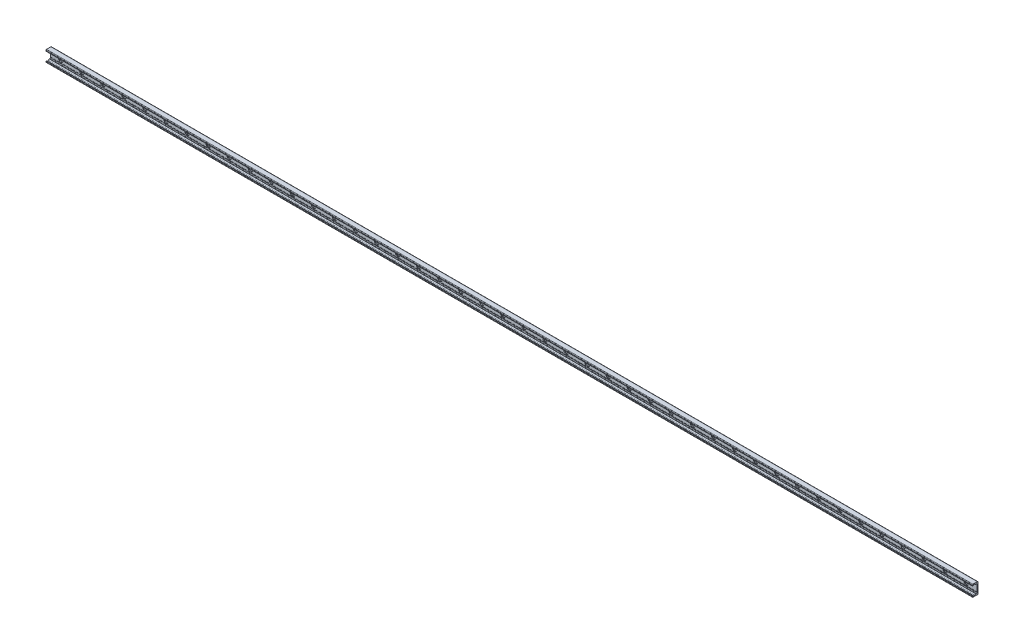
from build123d import *

# Parameters (mm, degrees)
BOSS_EXTRUDE1_DEPTH = 1760
SKETCH2_R           = 9
SKETCH2_R_2         = 4.5
CUT_EXTRUDE1_DEPTH  = 3.1
SKETCH2_2_R         = 4.5
CUT_EXTRUDE2_DEPTH  = 1761.208652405
LPATTERN1_COUNT     = 44
LPATTERN1_PITCH     = 80


with BuildPart() as part:
    # Sketch1 → Boss-Extrude1 (new, symmetric)
    with BuildSketch(Plane(origin=(0, 0, 0), x_dir=(0, 0, -1), z_dir=(1, 0, 0))):
        with BuildLine():
            Line((0, 0), (0, 19))
            ThreePointArc((0, 19), (-0.732233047, 20.767766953), (-2.5, 21.5))
            Line((-2.5, 21.5), (-19, 21.5))
            ThreePointArc((-19, 21.5), (-20.414213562, 20.914213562), (-21, 19.5))
            Line((-21, 19.5), (-21, 16.625057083))
            ThreePointArc((-21, 16.625057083), (-20.553251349, 15.888838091), (-19.693931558, 15.945160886))
            Line((-19.693931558, 15.945160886), (-16.794305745, 17.975500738))
            ThreePointArc((-16.794305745, 17.975500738), (-14.5, 18.69889256), (-12.205694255, 17.975500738))
            Line((-12.205694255, 17.975500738), (-8.829831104, 15.611695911))
            ThreePointArc((-8.829831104, 15.611695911), (-8.28408983, 15.342566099), (-7.682678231, 15.25))
            Line((-7.682678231, 15.25), (-6.5, 15.25))
            ThreePointArc((-6.5, 15.25), (-5.085786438, 14.664213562), (-4.5, 13.25))
            Line((-4.5, 13.25), (-4.5, -10.75))
            ThreePointArc((-4.5, -10.75), (-4.25, -11), (-4.5, -11.25))
            Line((-4.5, -11.25), (-4.5, -12.25))
            ThreePointArc((-4.5, -12.25), (-4.25, -12.5), (-4.5, -12.75))
            Line((-4.5, -12.75), (-4.5, -13.25))
            ThreePointArc((-4.5, -13.25), (-5.085786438, -14.664213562), (-6.5, -15.25))
            Line((-6.5, -15.25), (-7.682678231, -15.25))
            ThreePointArc((-7.682678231, -15.25), (-8.28408983, -15.342566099), (-8.829831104, -15.611695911))
            Line((-8.829831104, -15.611695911), (-12.205694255, -17.975500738))
            ThreePointArc((-12.205694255, -17.975500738), (-14.5, -18.69889256), (-16.794305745, -17.975500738))
            Line((-16.794305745, -17.975500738), (-19.693931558, -15.945160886))
            ThreePointArc((-19.693931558, -15.945160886), (-20.553251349, -15.888838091), (-21, -16.625057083))
            Line((-21, -16.625057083), (-21, -19.5))
            ThreePointArc((-21, -19.5), (-20.414213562, -20.914213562), (-19, -21.5))
            Line((-19, -21.5), (-2.5, -21.5))
            ThreePointArc((-2.5, -21.5), (-0.732233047, -20.767766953), (0, -19))
            Line((0, -19), (0, 0))
        make_face()
    extrude(amount=BOSS_EXTRUDE1_DEPTH, both=True)

    # Sketch2 → Cut-Extrude1 (cut)
    with BuildSketch(Plane.XY.offset(4.5)):
        with Locations((1720, 0)):
            Circle(SKETCH2_R)
        with Locations((1720, 0)):
            Circle(SKETCH2_R_2, mode=Mode.SUBTRACT)
    cut_extrude1 = extrude(amount=-CUT_EXTRUDE1_DEPTH, mode=Mode.SUBTRACT)

    # Sketch2_2 → Cut-Extrude2 (cut, through all)
    with BuildSketch(Plane.XY.offset(4.5)):
        with Locations((1720, 0)):
            Circle(SKETCH2_2_R)
    cut_extrude2 = extrude(amount=-CUT_EXTRUDE2_DEPTH, mode=Mode.SUBTRACT)

    # LPattern1: Cut-Extrude1, Cut-Extrude2 ×44
    with Locations(*[(-i * LPATTERN1_PITCH, 0, 0) for i in range(1, LPATTERN1_COUNT)]):
        add(cut_extrude1, mode=Mode.SUBTRACT)
        add(cut_extrude2, mode=Mode.SUBTRACT)


solid = part.part
